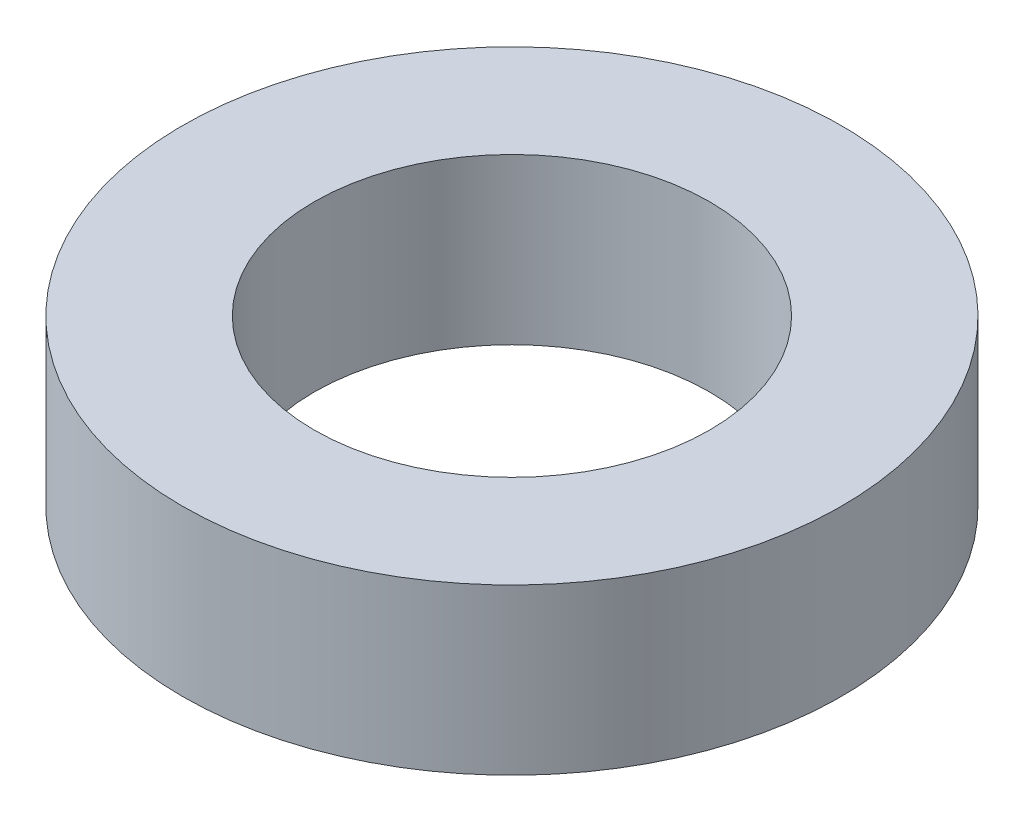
ISO-10303-21;
HEADER;
FILE_DESCRIPTION(('STEP AP214'),'2;1');
FILE_NAME('part.step','',(''),(''),'','','');
FILE_SCHEMA(('AUTOMOTIVE_DESIGN { 1 0 10303 214 1 1 1 1 }'));
ENDSEC;
DATA;
#1=APPLICATION_CONTEXT('core data for automotive mechanical design processes');
#2=APPLICATION_PROTOCOL_DEFINITION('international standard','automotive_design',2000,#1);
#3=PRODUCT_CONTEXT('',#1,'mechanical');
#4=PRODUCT('Part','Part','',(#3));
#5=PRODUCT_RELATED_PRODUCT_CATEGORY('part','',(#4));
#6=PRODUCT_DEFINITION_FORMATION('','',#4);
#7=PRODUCT_DEFINITION_CONTEXT('part definition',#1,'design');
#8=PRODUCT_DEFINITION('design','',#6,#7);
#9=PRODUCT_DEFINITION_SHAPE('','',#8);
#10=(LENGTH_UNIT() NAMED_UNIT(*) SI_UNIT(.MILLI.,.METRE.));
#11=(NAMED_UNIT(*) PLANE_ANGLE_UNIT() SI_UNIT($,.RADIAN.));
#12=(NAMED_UNIT(*) SI_UNIT($,.STERADIAN.) SOLID_ANGLE_UNIT());
#13=UNCERTAINTY_MEASURE_WITH_UNIT(LENGTH_MEASURE(1.E-05),#10,'distance_accuracy_value','');
#14=(GEOMETRIC_REPRESENTATION_CONTEXT(3) GLOBAL_UNCERTAINTY_ASSIGNED_CONTEXT((#13)) GLOBAL_UNIT_ASSIGNED_CONTEXT((#10,
#11,#12)) REPRESENTATION_CONTEXT('',''));
#15=CARTESIAN_POINT('',(0.,0.,0.));
#16=DIRECTION('',(0.,0.,1.));
#17=DIRECTION('',(1.,0.,0.));
#18=AXIS2_PLACEMENT_3D('',#15,#16,#17);
#19=CARTESIAN_POINT('',(0.,20.,0.));
#20=DIRECTION('',(0.,1.,0.));
#21=DIRECTION('',(0.,0.,1.));
#22=AXIS2_PLACEMENT_3D('',#19,#20,#21);
#23=PLANE('',#22);
#24=CARTESIAN_POINT('',(0.,20.,0.));
#25=DIRECTION('',(0.,1.,0.));
#26=DIRECTION('',(0.,0.,1.));
#27=AXIS2_PLACEMENT_3D('',#24,#25,#26);
#28=CIRCLE('',#27,40.);
#29=CARTESIAN_POINT('',(0.,20.,40.));
#30=VERTEX_POINT('',#29);
#31=EDGE_CURVE('E10',#30,#30,#28,.T.);
#32=ORIENTED_EDGE('',*,*,#31,.T.);
#33=EDGE_LOOP('',(#32));
#34=FACE_BOUND('',#33,.T.);
#35=CARTESIAN_POINT('',(0.,20.,0.));
#36=DIRECTION('',(0.,1.,0.));
#37=DIRECTION('',(0.,0.,1.));
#38=AXIS2_PLACEMENT_3D('',#35,#36,#37);
#39=CIRCLE('',#38,24.);
#40=CARTESIAN_POINT('',(0.,20.,24.));
#41=VERTEX_POINT('',#40);
#42=EDGE_CURVE('E39',#41,#41,#39,.T.);
#43=ORIENTED_EDGE('',*,*,#42,.F.);
#44=EDGE_LOOP('',(#43));
#45=FACE_BOUND('',#44,.T.);
#46=ADVANCED_FACE('F28',(#34,#45),#23,.T.);
#47=CARTESIAN_POINT('',(0.,0.,0.));
#48=DIRECTION('',(0.,1.,0.));
#49=DIRECTION('',(0.,0.,1.));
#50=AXIS2_PLACEMENT_3D('',#47,#48,#49);
#51=PLANE('',#50);
#52=CARTESIAN_POINT('',(0.,0.,0.));
#53=DIRECTION('',(0.,1.,0.));
#54=DIRECTION('',(0.,0.,1.));
#55=AXIS2_PLACEMENT_3D('',#52,#53,#54);
#56=CIRCLE('',#55,40.);
#57=CARTESIAN_POINT('',(0.,0.,40.));
#58=VERTEX_POINT('',#57);
#59=EDGE_CURVE('E35',#58,#58,#56,.T.);
#60=ORIENTED_EDGE('',*,*,#59,.F.);
#61=EDGE_LOOP('',(#60));
#62=FACE_BOUND('',#61,.T.);
#63=CARTESIAN_POINT('',(0.,0.,0.));
#64=DIRECTION('',(0.,1.,0.));
#65=DIRECTION('',(0.,0.,1.));
#66=AXIS2_PLACEMENT_3D('',#63,#64,#65);
#67=CIRCLE('',#66,24.);
#68=CARTESIAN_POINT('',(0.,0.,24.));
#69=VERTEX_POINT('',#68);
#70=EDGE_CURVE('E43',#69,#69,#67,.T.);
#71=ORIENTED_EDGE('',*,*,#70,.T.);
#72=EDGE_LOOP('',(#71));
#73=FACE_BOUND('',#72,.T.);
#74=ADVANCED_FACE('F49',(#62,#73),#51,.F.);
#75=CARTESIAN_POINT('',(0.,20.,0.));
#76=DIRECTION('',(0.,-1.,0.));
#77=DIRECTION('',(0.,0.,-1.));
#78=AXIS2_PLACEMENT_3D('',#75,#76,#77);
#79=CYLINDRICAL_SURFACE('',#78,40.);
#80=ORIENTED_EDGE('',*,*,#31,.F.);
#81=EDGE_LOOP('',(#80));
#82=FACE_BOUND('',#81,.T.);
#83=ORIENTED_EDGE('',*,*,#59,.T.);
#84=EDGE_LOOP('',(#83));
#85=FACE_BOUND('',#84,.T.);
#86=ADVANCED_FACE('F30',(#82,#85),#79,.T.);
#87=CARTESIAN_POINT('',(0.,20.,0.));
#88=DIRECTION('',(0.,-1.,0.));
#89=DIRECTION('',(0.,0.,-1.));
#90=AXIS2_PLACEMENT_3D('',#87,#88,#89);
#91=CYLINDRICAL_SURFACE('',#90,24.);
#92=ORIENTED_EDGE('',*,*,#42,.T.);
#93=EDGE_LOOP('',(#92));
#94=FACE_BOUND('',#93,.T.);
#95=ORIENTED_EDGE('',*,*,#70,.F.);
#96=EDGE_LOOP('',(#95));
#97=FACE_BOUND('',#96,.T.);
#98=ADVANCED_FACE('F51',(#94,#97),#91,.F.);
#99=CLOSED_SHELL('',(#46,#74,#86,#98));
#100=MANIFOLD_SOLID_BREP('B2',#99);
#101=ADVANCED_BREP_SHAPE_REPRESENTATION('',(#18,#100),#14);
#102=SHAPE_DEFINITION_REPRESENTATION(#9,#101);
ENDSEC;
END-ISO-10303-21;
